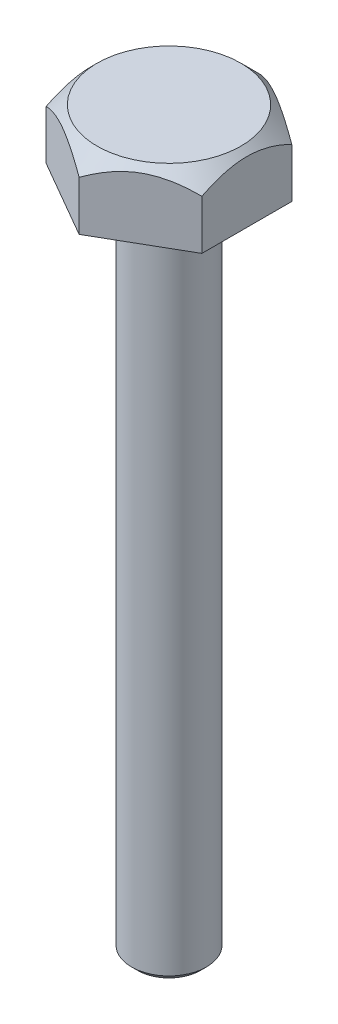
from build123d import *

# Parameters (mm, degrees)
BOSS_EXTRUDE1_DEPTH = 45
SKETCH3_R           = 25
BOSS_EXTRUDE2_DEPTH = 445
CHAMFER1_SIZE       = 4


with BuildPart() as part:
    # Sketch1 → Boss-Extrude1 (new body)
    with BuildSketch(Plane(origin=(0, 0, 0), x_dir=(1, 0, 0), z_dir=(0, 1, 0))):
        Polygon((0, -60), (51.961524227, -30), (51.961524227, 30), (0, 60), (-51.961524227, 30), (-51.961524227, -30), align=None)
    extrude(amount=BOSS_EXTRUDE1_DEPTH)

    # Sketch2 → Cut-Revolve1 (revolve, cut)
    with BuildSketch(Plane(origin=(0, 0, 0), x_dir=(0, 0, -1), z_dir=(1, 0, 0))):
        Polygon((48, 45), (60, 33), (60, 45), align=None)
    revolve(axis=Axis((0, 0, 0), (0, 1, 0)), mode=Mode.SUBTRACT)

    # Sketch3 → Boss-Extrude2 (add)
    with BuildSketch(Plane.XZ):
        with Locations(Location((0, 0, 0), (0, 0, 270))):
            Circle(SKETCH3_R)
    extrude(amount=BOSS_EXTRUDE2_DEPTH)

    # Chamfer1
    chamfer1_edges = [part.edges().sort_by_distance(p)[0] for p in [
        (0, -445, 25),
    ]]
    chamfer(chamfer1_edges, length=CHAMFER1_SIZE)


solid = part.part
